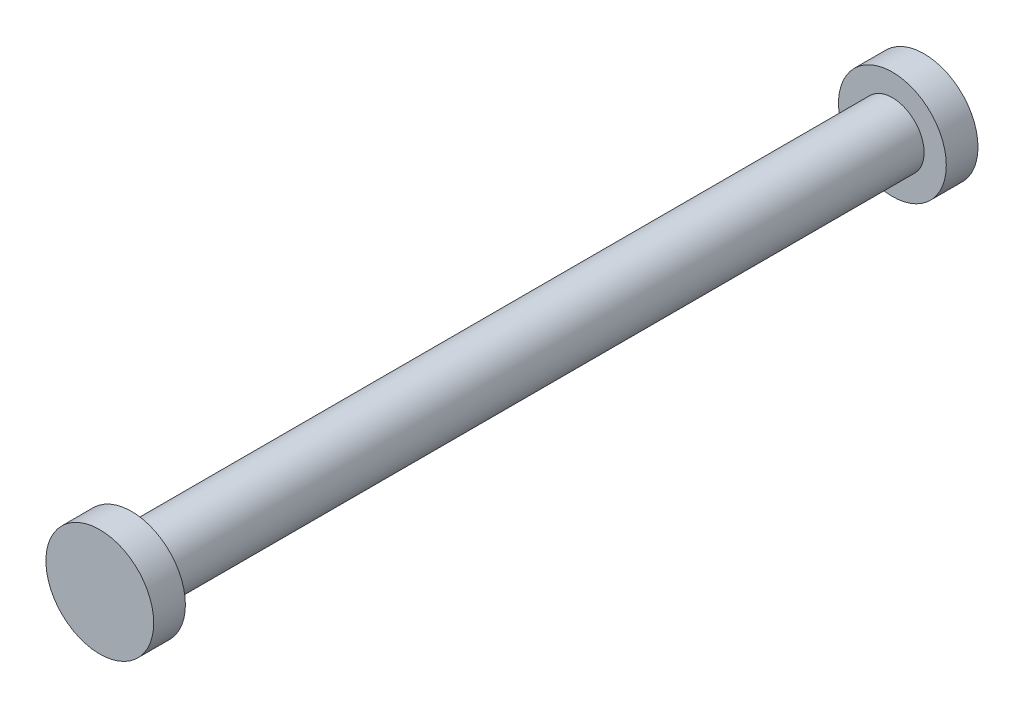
ISO-10303-21;
HEADER;
FILE_DESCRIPTION(('STEP AP214'),'2;1');
FILE_NAME('part.step','',(''),(''),'','','');
FILE_SCHEMA(('AUTOMOTIVE_DESIGN { 1 0 10303 214 1 1 1 1 }'));
ENDSEC;
DATA;
#1=APPLICATION_CONTEXT('core data for automotive mechanical design processes');
#2=APPLICATION_PROTOCOL_DEFINITION('international standard','automotive_design',2000,#1);
#3=PRODUCT_CONTEXT('',#1,'mechanical');
#4=PRODUCT('Part','Part','',(#3));
#5=PRODUCT_RELATED_PRODUCT_CATEGORY('part','',(#4));
#6=PRODUCT_DEFINITION_FORMATION('','',#4);
#7=PRODUCT_DEFINITION_CONTEXT('part definition',#1,'design');
#8=PRODUCT_DEFINITION('design','',#6,#7);
#9=PRODUCT_DEFINITION_SHAPE('','',#8);
#10=(LENGTH_UNIT() NAMED_UNIT(*) SI_UNIT(.MILLI.,.METRE.));
#11=(NAMED_UNIT(*) PLANE_ANGLE_UNIT() SI_UNIT($,.RADIAN.));
#12=(NAMED_UNIT(*) SI_UNIT($,.STERADIAN.) SOLID_ANGLE_UNIT());
#13=UNCERTAINTY_MEASURE_WITH_UNIT(LENGTH_MEASURE(1.E-05),#10,'distance_accuracy_value','');
#14=(GEOMETRIC_REPRESENTATION_CONTEXT(3) GLOBAL_UNCERTAINTY_ASSIGNED_CONTEXT((#13)) GLOBAL_UNIT_ASSIGNED_CONTEXT((#10,
#11,#12)) REPRESENTATION_CONTEXT('',''));
#15=CARTESIAN_POINT('',(0.,0.,0.));
#16=DIRECTION('',(0.,0.,1.));
#17=DIRECTION('',(1.,0.,0.));
#18=AXIS2_PLACEMENT_3D('',#15,#16,#17);
#19=CARTESIAN_POINT('',(-425.1,65.,-65.));
#20=DIRECTION('',(0.,0.,1.));
#21=DIRECTION('',(1.,0.,0.));
#22=AXIS2_PLACEMENT_3D('',#19,#20,#21);
#23=CYLINDRICAL_SURFACE('',#22,5.);
#24=CARTESIAN_POINT('',(-425.1,65.,-60.));
#25=DIRECTION('',(0.,0.,1.));
#26=DIRECTION('',(1.,0.,0.));
#27=AXIS2_PLACEMENT_3D('',#24,#25,#26);
#28=CIRCLE('',#27,5.);
#29=CARTESIAN_POINT('',(-420.1,65.,-60.));
#30=VERTEX_POINT('',#29);
#31=EDGE_CURVE('E11',#30,#30,#28,.F.);
#32=ORIENTED_EDGE('',*,*,#31,.F.);
#33=EDGE_LOOP('',(#32));
#34=FACE_BOUND('',#33,.T.);
#35=CARTESIAN_POINT('',(-425.1,65.,60.));
#36=DIRECTION('',(0.,0.,1.));
#37=DIRECTION('',(1.,0.,0.));
#38=AXIS2_PLACEMENT_3D('',#35,#36,#37);
#39=CIRCLE('',#38,5.);
#40=CARTESIAN_POINT('',(-420.1,65.,60.));
#41=VERTEX_POINT('',#40);
#42=EDGE_CURVE('E57',#41,#41,#39,.F.);
#43=ORIENTED_EDGE('',*,*,#42,.T.);
#44=EDGE_LOOP('',(#43));
#45=FACE_BOUND('',#44,.T.);
#46=ADVANCED_FACE('F50',(#34,#45),#23,.T.);
#47=CARTESIAN_POINT('',(-425.1,65.,60.));
#48=DIRECTION('',(0.,0.,1.));
#49=DIRECTION('',(1.,0.,0.));
#50=AXIS2_PLACEMENT_3D('',#47,#48,#49);
#51=PLANE('',#50);
#52=ORIENTED_EDGE('',*,*,#42,.F.);
#53=EDGE_LOOP('',(#52));
#54=FACE_BOUND('',#53,.T.);
#55=CARTESIAN_POINT('',(-425.1,65.,60.));
#56=DIRECTION('',(0.,0.,1.));
#57=DIRECTION('',(1.,0.,0.));
#58=AXIS2_PLACEMENT_3D('',#55,#56,#57);
#59=CIRCLE('',#58,8.50000000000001);
#60=CARTESIAN_POINT('',(-416.6,65.,60.));
#61=VERTEX_POINT('',#60);
#62=EDGE_CURVE('E65',#61,#61,#59,.T.);
#63=ORIENTED_EDGE('',*,*,#62,.F.);
#64=EDGE_LOOP('',(#63));
#65=FACE_BOUND('',#64,.T.);
#66=ADVANCED_FACE('F90',(#54,#65),#51,.F.);
#67=CARTESIAN_POINT('',(-425.1,65.,60.));
#68=DIRECTION('',(0.,0.,1.));
#69=DIRECTION('',(1.,0.,0.));
#70=AXIS2_PLACEMENT_3D('',#67,#68,#69);
#71=CYLINDRICAL_SURFACE('',#70,8.50000000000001);
#72=CARTESIAN_POINT('',(-425.1,65.,65.));
#73=DIRECTION('',(0.,0.,1.));
#74=DIRECTION('',(1.,0.,0.));
#75=AXIS2_PLACEMENT_3D('',#72,#73,#74);
#76=CIRCLE('',#75,8.50000000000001);
#77=CARTESIAN_POINT('',(-416.6,65.,65.));
#78=VERTEX_POINT('',#77);
#79=EDGE_CURVE('E61',#78,#78,#76,.T.);
#80=ORIENTED_EDGE('',*,*,#79,.F.);
#81=EDGE_LOOP('',(#80));
#82=FACE_BOUND('',#81,.T.);
#83=ORIENTED_EDGE('',*,*,#62,.T.);
#84=EDGE_LOOP('',(#83));
#85=FACE_BOUND('',#84,.T.);
#86=ADVANCED_FACE('F93',(#82,#85),#71,.T.);
#87=CARTESIAN_POINT('',(-425.1,65.,65.));
#88=DIRECTION('',(0.,0.,1.));
#89=DIRECTION('',(1.,0.,0.));
#90=AXIS2_PLACEMENT_3D('',#87,#88,#89);
#91=PLANE('',#90);
#92=ORIENTED_EDGE('',*,*,#79,.T.);
#93=EDGE_LOOP('',(#92));
#94=FACE_BOUND('',#93,.T.);
#95=ADVANCED_FACE('F86',(#94),#91,.T.);
#96=CARTESIAN_POINT('',(-425.1,65.,-60.));
#97=DIRECTION('',(0.,0.,1.));
#98=DIRECTION('',(1.,0.,0.));
#99=AXIS2_PLACEMENT_3D('',#96,#97,#98);
#100=PLANE('',#99);
#101=ORIENTED_EDGE('',*,*,#31,.T.);
#102=EDGE_LOOP('',(#101));
#103=FACE_BOUND('',#102,.T.);
#104=CARTESIAN_POINT('',(-425.1,65.,-60.));
#105=DIRECTION('',(0.,0.,1.));
#106=DIRECTION('',(1.,0.,0.));
#107=AXIS2_PLACEMENT_3D('',#104,#105,#106);
#108=CIRCLE('',#107,8.50000000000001);
#109=CARTESIAN_POINT('',(-416.6,65.,-60.));
#110=VERTEX_POINT('',#109);
#111=EDGE_CURVE('E70',#110,#110,#108,.T.);
#112=ORIENTED_EDGE('',*,*,#111,.T.);
#113=EDGE_LOOP('',(#112));
#114=FACE_BOUND('',#113,.T.);
#115=ADVANCED_FACE('F80',(#103,#114),#100,.T.);
#116=CARTESIAN_POINT('',(-425.1,65.,-65.));
#117=DIRECTION('',(0.,0.,1.));
#118=DIRECTION('',(1.,0.,0.));
#119=AXIS2_PLACEMENT_3D('',#116,#117,#118);
#120=CYLINDRICAL_SURFACE('',#119,8.50000000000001);
#121=ORIENTED_EDGE('',*,*,#111,.F.);
#122=EDGE_LOOP('',(#121));
#123=FACE_BOUND('',#122,.T.);
#124=CARTESIAN_POINT('',(-425.1,65.,-65.));
#125=DIRECTION('',(0.,0.,1.));
#126=DIRECTION('',(1.,0.,0.));
#127=AXIS2_PLACEMENT_3D('',#124,#125,#126);
#128=CIRCLE('',#127,8.50000000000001);
#129=CARTESIAN_POINT('',(-416.6,65.,-65.));
#130=VERTEX_POINT('',#129);
#131=EDGE_CURVE('E73',#130,#130,#128,.T.);
#132=ORIENTED_EDGE('',*,*,#131,.T.);
#133=EDGE_LOOP('',(#132));
#134=FACE_BOUND('',#133,.T.);
#135=ADVANCED_FACE('F77',(#123,#134),#120,.T.);
#136=CARTESIAN_POINT('',(-425.1,65.,-65.));
#137=DIRECTION('',(0.,0.,1.));
#138=DIRECTION('',(1.,0.,0.));
#139=AXIS2_PLACEMENT_3D('',#136,#137,#138);
#140=PLANE('',#139);
#141=ORIENTED_EDGE('',*,*,#131,.F.);
#142=EDGE_LOOP('',(#141));
#143=FACE_BOUND('',#142,.T.);
#144=ADVANCED_FACE('F52',(#143),#140,.F.);
#145=CLOSED_SHELL('',(#46,#66,#86,#95,#115,#135,#144));
#146=MANIFOLD_SOLID_BREP('B2',#145);
#147=ADVANCED_BREP_SHAPE_REPRESENTATION('',(#18,#146),#14);
#148=SHAPE_DEFINITION_REPRESENTATION(#9,#147);
ENDSEC;
END-ISO-10303-21;
